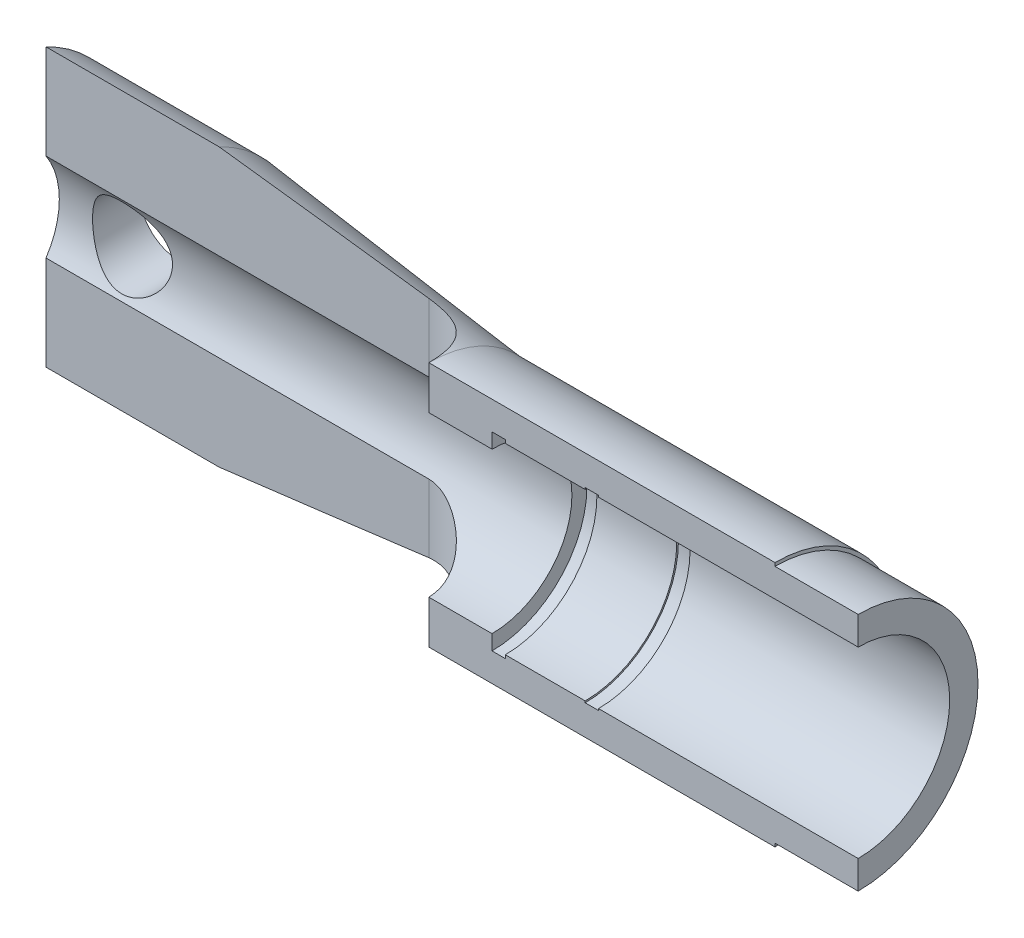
from build123d import *

# Parameters (mm, degrees)
R_VOLUTION1_ANGLE            = 180
ENL_V_MAT_EXTRU_1_DEPTH      = 272.972402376
ENL_V_MAT_EXTRU_1_DEPTH_BACK = 272.972402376
ENL_V_MAT_EXTRU_2_REACH      = 273.236
ENL_V_MAT_EXTRU_2_END_RADIUS = 46.222222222
ESQUISSE3_R                  = 12
ESQUISSE4_W                  = 32.807342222
ESQUISSE4_H                  = 87.363371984
ENL_V_MAT_EXTRU_3_DEPTH      = 37


with BuildPart() as part:
    # Esquisse1 → R_volution1 (revolve)
    with BuildSketch(Plane.XY):
        Polygon((0, 36), (0, 27.5), (-78, 27.5), (-78, 28), (-82, 28), (-82, 27.5), (-106, 27.5), (-106, 28.5), (-110, 28.5), (-110, 24), (-264, 24), (-264, 46.222222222), (-212, 46.222222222), (-192, 44), (-129, 37), (-25, 37), (-25, 36), align=None)
    revolve(axis=Axis((0, 0, 0), (-1, 0, 0)), revolution_arc=R_VOLUTION1_ANGLE)

    # Esquisse2 → Enl_v. mat.-Extru.1 (cut, two sides: drawn at the far end of the back side and taken through both)
    with BuildSketch(Plane(origin=(0, 0, 0), x_dir=(1, 0, 0), z_dir=(0, 1, 0)).offset(-ENL_V_MAT_EXTRU_1_DEPTH_BACK)):
        with BuildLine():
            Line((-264, 0), (-264, 20))
            Line((-264, 20), (-149, 20))
            ThreePointArc((-149, 20), (-134.857864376, 14.142135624), (-129, 0))
            Line((-129, 0), (-212, 0))
            Line((-212, 0), (-264, 0))
        make_face()
    extrude(amount=ENL_V_MAT_EXTRU_1_DEPTH + ENL_V_MAT_EXTRU_1_DEPTH_BACK, mode=Mode.SUBTRACT)

    # Enl_v. mat.-Extru.2: up to this cylinder (the profile starts inside it)
    enl_v_mat_extru_2_end = Plane(origin=(-242, 0, 0), z_dir=(1, 0, 0)) * Cylinder(ENL_V_MAT_EXTRU_2_END_RADIUS, 639.916444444, mode=Mode.PRIVATE)
    # Esquisse3 → Enl_v. mat.-Extru.2 (cut, up to the surface)
    with BuildSketch(Plane.XY, mode=Mode.PRIVATE) as enl_v_mat_extru_2_sk1:
        with Locations((-242, 0)):
            Circle(ESQUISSE3_R)
    enl_v_mat_extru_2_tool1 = extrude(enl_v_mat_extru_2_sk1.sketch, amount=-ENL_V_MAT_EXTRU_2_REACH, mode=Mode.PRIVATE) & enl_v_mat_extru_2_end
    add(enl_v_mat_extru_2_tool1.solids().sort_by_distance((-242, 0, 0))[0], mode=Mode.SUBTRACT)

    # Esquisse4 → Enl_v. mat.-Extru.3 (cut)
    with BuildSketch(Plane.ZY.offset(264)):
        with Locations((-54.403671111, 0)):
            Rectangle(ESQUISSE4_W, ESQUISSE4_H)
    extrude(amount=-ENL_V_MAT_EXTRU_3_DEPTH, mode=Mode.SUBTRACT)


solid = part.part
